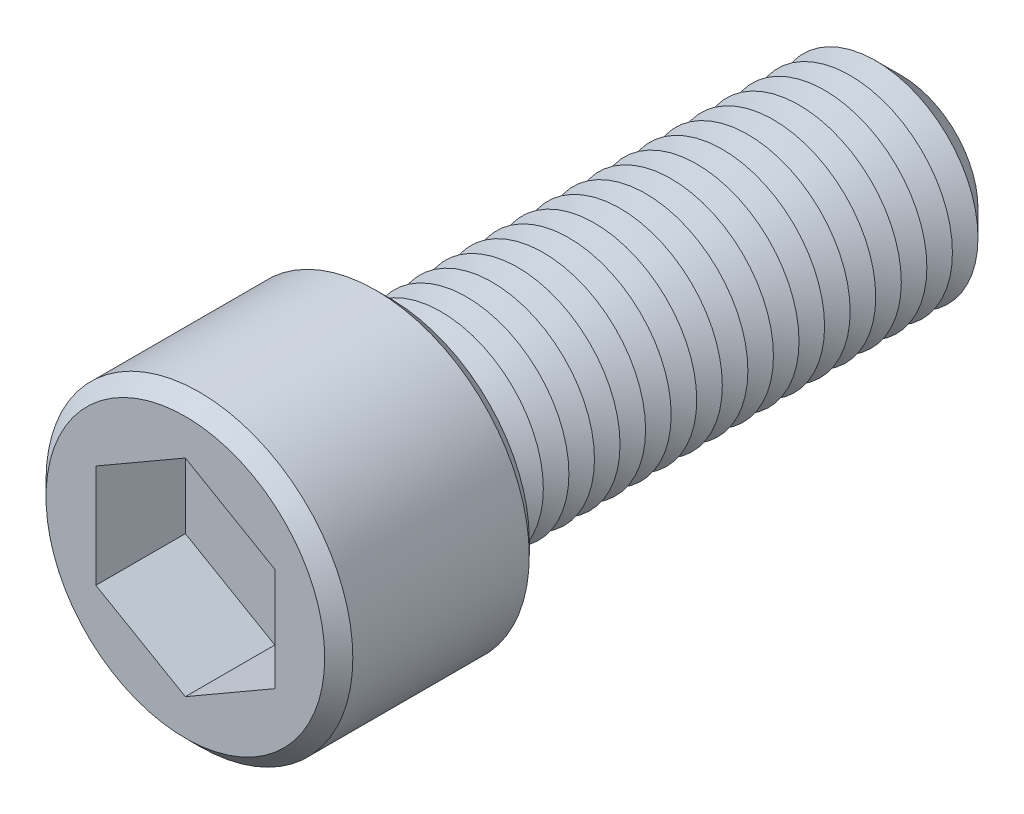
ISO-10303-21;
HEADER;
FILE_DESCRIPTION(('STEP AP214'),'2;1');
FILE_NAME('part.step','',(''),(''),'','','');
FILE_SCHEMA(('AUTOMOTIVE_DESIGN { 1 0 10303 214 1 1 1 1 }'));
ENDSEC;
DATA;
#1=APPLICATION_CONTEXT('core data for automotive mechanical design processes');
#2=APPLICATION_PROTOCOL_DEFINITION('international standard','automotive_design',2000,#1);
#3=PRODUCT_CONTEXT('',#1,'mechanical');
#4=PRODUCT('Part','Part','',(#3));
#5=PRODUCT_RELATED_PRODUCT_CATEGORY('part','',(#4));
#6=PRODUCT_DEFINITION_FORMATION('','',#4);
#7=PRODUCT_DEFINITION_CONTEXT('part definition',#1,'design');
#8=PRODUCT_DEFINITION('design','',#6,#7);
#9=PRODUCT_DEFINITION_SHAPE('','',#8);
#10=(LENGTH_UNIT() NAMED_UNIT(*) SI_UNIT(.MILLI.,.METRE.));
#11=(NAMED_UNIT(*) PLANE_ANGLE_UNIT() SI_UNIT($,.RADIAN.));
#12=(NAMED_UNIT(*) SI_UNIT($,.STERADIAN.) SOLID_ANGLE_UNIT());
#13=UNCERTAINTY_MEASURE_WITH_UNIT(LENGTH_MEASURE(1.E-05),#10,'distance_accuracy_value','');
#14=(GEOMETRIC_REPRESENTATION_CONTEXT(3) GLOBAL_UNCERTAINTY_ASSIGNED_CONTEXT((#13)) GLOBAL_UNIT_ASSIGNED_CONTEXT((#10,
#11,#12)) REPRESENTATION_CONTEXT('',''));
#15=CARTESIAN_POINT('',(0.,0.,0.));
#16=DIRECTION('',(0.,0.,1.));
#17=DIRECTION('',(1.,0.,0.));
#18=AXIS2_PLACEMENT_3D('',#15,#16,#17);
#19=CARTESIAN_POINT('',(0.,0.,16.));
#20=DIRECTION('',(0.,0.,-1.));
#21=DIRECTION('',(-1.,0.,0.));
#22=AXIS2_PLACEMENT_3D('',#19,#20,#21);
#23=CYLINDRICAL_SURFACE('',#22,12.);
#24=CARTESIAN_POINT('',(0.,0.,1.09999999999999));
#25=DIRECTION('',(0.,0.,1.));
#26=DIRECTION('',(1.,0.,0.));
#27=AXIS2_PLACEMENT_3D('',#24,#25,#26);
#28=CIRCLE('',#27,12.);
#29=CARTESIAN_POINT('',(12.,0.,1.09999999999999));
#30=VERTEX_POINT('',#29);
#31=EDGE_CURVE('E328',#30,#30,#28,.T.);
#32=ORIENTED_EDGE('',*,*,#31,.T.);
#33=EDGE_LOOP('',(#32));
#34=FACE_BOUND('',#33,.T.);
#35=CARTESIAN_POINT('',(0.,0.,14.9));
#36=DIRECTION('',(0.,0.,1.));
#37=DIRECTION('',(1.,0.,0.));
#38=AXIS2_PLACEMENT_3D('',#35,#36,#37);
#39=CIRCLE('',#38,12.);
#40=CARTESIAN_POINT('',(12.,0.,14.9));
#41=VERTEX_POINT('',#40);
#42=EDGE_CURVE('E324',#41,#41,#39,.F.);
#43=ORIENTED_EDGE('',*,*,#42,.T.);
#44=EDGE_LOOP('',(#43));
#45=FACE_BOUND('',#44,.T.);
#46=ADVANCED_FACE('F39',(#34,#45),#23,.T.);
#47=CARTESIAN_POINT('',(0.,0.,16.));
#48=DIRECTION('',(0.,0.,1.));
#49=DIRECTION('',(1.,0.,0.));
#50=AXIS2_PLACEMENT_3D('',#47,#48,#49);
#51=PLANE('',#50);
#52=CARTESIAN_POINT('',(0.,0.,16.));
#53=DIRECTION('',(0.,0.,1.));
#54=DIRECTION('',(1.,0.,0.));
#55=AXIS2_PLACEMENT_3D('',#52,#53,#54);
#56=CIRCLE('',#55,10.9);
#57=CARTESIAN_POINT('',(10.9,0.,16.));
#58=VERTEX_POINT('',#57);
#59=EDGE_CURVE('E11',#58,#58,#56,.T.);
#60=ORIENTED_EDGE('',*,*,#59,.T.);
#61=EDGE_LOOP('',(#60));
#62=FACE_BOUND('',#61,.T.);
#63=DIRECTION('',(-0.866025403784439,0.5,0.));
#64=VECTOR('',#63,1.);
#65=CARTESIAN_POINT('',(7.,4.04145188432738,16.));
#66=LINE('',#65,#64);
#67=CARTESIAN_POINT('',(7.,4.04145188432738,16.));
#68=VERTEX_POINT('',#67);
#69=CARTESIAN_POINT('',(0.,8.08290376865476,16.));
#70=VERTEX_POINT('',#69);
#71=EDGE_CURVE('E55',#68,#70,#66,.T.);
#72=ORIENTED_EDGE('',*,*,#71,.F.);
#73=DIRECTION('',(0.,1.,0.));
#74=VECTOR('',#73,1.);
#75=CARTESIAN_POINT('',(7.,-4.04145188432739,16.));
#76=LINE('',#75,#74);
#77=CARTESIAN_POINT('',(7.,-4.04145188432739,16.));
#78=VERTEX_POINT('',#77);
#79=EDGE_CURVE('E150',#78,#68,#76,.T.);
#80=ORIENTED_EDGE('',*,*,#79,.F.);
#81=DIRECTION('',(0.866025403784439,0.5,0.));
#82=VECTOR('',#81,1.);
#83=CARTESIAN_POINT('',(0.,-8.08290376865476,16.));
#84=LINE('',#83,#82);
#85=CARTESIAN_POINT('',(0.,-8.08290376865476,16.));
#86=VERTEX_POINT('',#85);
#87=EDGE_CURVE('E147',#86,#78,#84,.T.);
#88=ORIENTED_EDGE('',*,*,#87,.F.);
#89=DIRECTION('',(0.866025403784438,-0.5,0.));
#90=VECTOR('',#89,1.);
#91=CARTESIAN_POINT('',(-7.,-4.04145188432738,16.));
#92=LINE('',#91,#90);
#93=CARTESIAN_POINT('',(-7.,-4.04145188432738,16.));
#94=VERTEX_POINT('',#93);
#95=EDGE_CURVE('E103',#94,#86,#92,.T.);
#96=ORIENTED_EDGE('',*,*,#95,.F.);
#97=DIRECTION('',(0.,-1.,0.));
#98=VECTOR('',#97,1.);
#99=CARTESIAN_POINT('',(-7.,4.04145188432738,16.));
#100=LINE('',#99,#98);
#101=CARTESIAN_POINT('',(-7.,4.04145188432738,16.));
#102=VERTEX_POINT('',#101);
#103=EDGE_CURVE('E141',#102,#94,#100,.T.);
#104=ORIENTED_EDGE('',*,*,#103,.F.);
#105=DIRECTION('',(-0.866025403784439,-0.5,0.));
#106=VECTOR('',#105,1.);
#107=CARTESIAN_POINT('',(0.,8.08290376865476,16.));
#108=LINE('',#107,#106);
#109=EDGE_CURVE('E136',#70,#102,#108,.T.);
#110=ORIENTED_EDGE('',*,*,#109,.F.);
#111=EDGE_LOOP('',(#72,#80,#88,#96,#104,#110));
#112=FACE_BOUND('',#111,.T.);
#113=ADVANCED_FACE('F346',(#62,#112),#51,.T.);
#114=CARTESIAN_POINT('',(0.,0.,0.));
#115=DIRECTION('',(0.,0.,1.));
#116=DIRECTION('',(1.,0.,0.));
#117=AXIS2_PLACEMENT_3D('',#114,#115,#116);
#118=PLANE('',#117);
#119=CARTESIAN_POINT('',(0.,0.,0.));
#120=DIRECTION('',(0.,0.,1.));
#121=DIRECTION('',(1.,0.,0.));
#122=AXIS2_PLACEMENT_3D('',#119,#120,#121);
#123=CIRCLE('',#122,10.9);
#124=CARTESIAN_POINT('',(10.9,0.,0.));
#125=VERTEX_POINT('',#124);
#126=EDGE_CURVE('E48',#125,#125,#123,.F.);
#127=ORIENTED_EDGE('',*,*,#126,.T.);
#128=EDGE_LOOP('',(#127));
#129=FACE_BOUND('',#128,.T.);
#130=CARTESIAN_POINT('',(0.,0.,0.));
#131=DIRECTION('',(0.,0.,1.));
#132=DIRECTION('',(1.,0.,0.));
#133=AXIS2_PLACEMENT_3D('',#130,#131,#132);
#134=CIRCLE('',#133,8.);
#135=CARTESIAN_POINT('',(8.,0.,0.));
#136=VERTEX_POINT('',#135);
#137=EDGE_CURVE('E316',#136,#136,#134,.T.);
#138=ORIENTED_EDGE('',*,*,#137,.T.);
#139=EDGE_LOOP('',(#138));
#140=FACE_BOUND('',#139,.T.);
#141=ADVANCED_FACE('F335',(#129,#140),#118,.F.);
#142=CARTESIAN_POINT('',(0.,0.,0.));
#143=DIRECTION('',(0.,0.,1.));
#144=DIRECTION('',(1.,0.,0.));
#145=AXIS2_PLACEMENT_3D('',#142,#143,#144);
#146=CONICAL_SURFACE('',#145,8.,1.0471975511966);
#147=CARTESIAN_POINT('',(0.,0.,-1.));
#148=DIRECTION('',(0.,0.,1.));
#149=DIRECTION('',(1.,0.,0.));
#150=AXIS2_PLACEMENT_3D('',#147,#148,#149);
#151=CIRCLE('',#150,6.26794919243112);
#152=CARTESIAN_POINT('',(6.26794919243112,0.,-1.));
#153=VERTEX_POINT('',#152);
#154=EDGE_CURVE('E312',#153,#153,#151,.T.);
#155=ORIENTED_EDGE('',*,*,#154,.T.);
#156=EDGE_LOOP('',(#155));
#157=FACE_BOUND('',#156,.T.);
#158=ORIENTED_EDGE('',*,*,#137,.F.);
#159=EDGE_LOOP('',(#158));
#160=FACE_BOUND('',#159,.T.);
#161=ADVANCED_FACE('F548',(#157,#160),#146,.T.);
#162=CARTESIAN_POINT('',(0.,0.,-1.));
#163=DIRECTION('',(0.,0.,-1.));
#164=DIRECTION('',(-1.,0.,0.));
#165=AXIS2_PLACEMENT_3D('',#162,#163,#164);
#166=CONICAL_SURFACE('',#165,6.26794919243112,1.0471975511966);
#167=CARTESIAN_POINT('',(0.,0.,-2.));
#168=DIRECTION('',(0.,0.,1.));
#169=DIRECTION('',(1.,0.,0.));
#170=AXIS2_PLACEMENT_3D('',#167,#168,#169);
#171=CIRCLE('',#170,8.);
#172=CARTESIAN_POINT('',(8.,0.,-2.));
#173=VERTEX_POINT('',#172);
#174=EDGE_CURVE('E308',#173,#173,#171,.T.);
#175=ORIENTED_EDGE('',*,*,#174,.T.);
#176=EDGE_LOOP('',(#175));
#177=FACE_BOUND('',#176,.T.);
#178=ORIENTED_EDGE('',*,*,#154,.F.);
#179=EDGE_LOOP('',(#178));
#180=FACE_BOUND('',#179,.T.);
#181=ADVANCED_FACE('F544',(#177,#180),#166,.T.);
#182=CARTESIAN_POINT('',(0.,0.,-2.));
#183=DIRECTION('',(0.,0.,1.));
#184=DIRECTION('',(1.,0.,0.));
#185=AXIS2_PLACEMENT_3D('',#182,#183,#184);
#186=CONICAL_SURFACE('',#185,8.,1.0471975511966);
#187=CARTESIAN_POINT('',(0.,0.,-3.));
#188=DIRECTION('',(0.,0.,1.));
#189=DIRECTION('',(1.,0.,0.));
#190=AXIS2_PLACEMENT_3D('',#187,#188,#189);
#191=CIRCLE('',#190,6.26794919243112);
#192=CARTESIAN_POINT('',(6.26794919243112,0.,-3.));
#193=VERTEX_POINT('',#192);
#194=EDGE_CURVE('E304',#193,#193,#191,.T.);
#195=ORIENTED_EDGE('',*,*,#194,.T.);
#196=EDGE_LOOP('',(#195));
#197=FACE_BOUND('',#196,.T.);
#198=ORIENTED_EDGE('',*,*,#174,.F.);
#199=EDGE_LOOP('',(#198));
#200=FACE_BOUND('',#199,.T.);
#201=ADVANCED_FACE('F540',(#197,#200),#186,.T.);
#202=CARTESIAN_POINT('',(0.,0.,-3.));
#203=DIRECTION('',(0.,0.,-1.));
#204=DIRECTION('',(-1.,0.,0.));
#205=AXIS2_PLACEMENT_3D('',#202,#203,#204);
#206=CONICAL_SURFACE('',#205,6.26794919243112,1.0471975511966);
#207=CARTESIAN_POINT('',(0.,0.,-4.));
#208=DIRECTION('',(0.,0.,1.));
#209=DIRECTION('',(1.,0.,0.));
#210=AXIS2_PLACEMENT_3D('',#207,#208,#209);
#211=CIRCLE('',#210,8.);
#212=CARTESIAN_POINT('',(8.,0.,-4.));
#213=VERTEX_POINT('',#212);
#214=EDGE_CURVE('E300',#213,#213,#211,.T.);
#215=ORIENTED_EDGE('',*,*,#214,.T.);
#216=EDGE_LOOP('',(#215));
#217=FACE_BOUND('',#216,.T.);
#218=ORIENTED_EDGE('',*,*,#194,.F.);
#219=EDGE_LOOP('',(#218));
#220=FACE_BOUND('',#219,.T.);
#221=ADVANCED_FACE('F536',(#217,#220),#206,.T.);
#222=CARTESIAN_POINT('',(0.,0.,-4.));
#223=DIRECTION('',(0.,0.,1.));
#224=DIRECTION('',(1.,0.,0.));
#225=AXIS2_PLACEMENT_3D('',#222,#223,#224);
#226=CONICAL_SURFACE('',#225,8.,1.0471975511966);
#227=CARTESIAN_POINT('',(0.,0.,-5.));
#228=DIRECTION('',(0.,0.,1.));
#229=DIRECTION('',(1.,0.,0.));
#230=AXIS2_PLACEMENT_3D('',#227,#228,#229);
#231=CIRCLE('',#230,6.26794919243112);
#232=CARTESIAN_POINT('',(6.26794919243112,0.,-5.));
#233=VERTEX_POINT('',#232);
#234=EDGE_CURVE('E297',#233,#233,#231,.T.);
#235=ORIENTED_EDGE('',*,*,#234,.T.);
#236=EDGE_LOOP('',(#235));
#237=FACE_BOUND('',#236,.T.);
#238=ORIENTED_EDGE('',*,*,#214,.F.);
#239=EDGE_LOOP('',(#238));
#240=FACE_BOUND('',#239,.T.);
#241=ADVANCED_FACE('F532',(#237,#240),#226,.T.);
#242=CARTESIAN_POINT('',(0.,0.,-5.));
#243=DIRECTION('',(0.,0.,-1.));
#244=DIRECTION('',(-1.,0.,0.));
#245=AXIS2_PLACEMENT_3D('',#242,#243,#244);
#246=CONICAL_SURFACE('',#245,6.26794919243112,1.0471975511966);
#247=CARTESIAN_POINT('',(0.,0.,-6.));
#248=DIRECTION('',(0.,0.,1.));
#249=DIRECTION('',(1.,0.,0.));
#250=AXIS2_PLACEMENT_3D('',#247,#248,#249);
#251=CIRCLE('',#250,8.);
#252=CARTESIAN_POINT('',(8.,0.,-6.));
#253=VERTEX_POINT('',#252);
#254=EDGE_CURVE('E293',#253,#253,#251,.T.);
#255=ORIENTED_EDGE('',*,*,#254,.T.);
#256=EDGE_LOOP('',(#255));
#257=FACE_BOUND('',#256,.T.);
#258=ORIENTED_EDGE('',*,*,#234,.F.);
#259=EDGE_LOOP('',(#258));
#260=FACE_BOUND('',#259,.T.);
#261=ADVANCED_FACE('F528',(#257,#260),#246,.T.);
#262=CARTESIAN_POINT('',(0.,0.,-6.));
#263=DIRECTION('',(0.,0.,1.));
#264=DIRECTION('',(1.,0.,0.));
#265=AXIS2_PLACEMENT_3D('',#262,#263,#264);
#266=CONICAL_SURFACE('',#265,8.,1.0471975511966);
#267=CARTESIAN_POINT('',(0.,0.,-7.));
#268=DIRECTION('',(0.,0.,1.));
#269=DIRECTION('',(1.,0.,0.));
#270=AXIS2_PLACEMENT_3D('',#267,#268,#269);
#271=CIRCLE('',#270,6.26794919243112);
#272=CARTESIAN_POINT('',(6.26794919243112,0.,-7.));
#273=VERTEX_POINT('',#272);
#274=EDGE_CURVE('E289',#273,#273,#271,.T.);
#275=ORIENTED_EDGE('',*,*,#274,.T.);
#276=EDGE_LOOP('',(#275));
#277=FACE_BOUND('',#276,.T.);
#278=ORIENTED_EDGE('',*,*,#254,.F.);
#279=EDGE_LOOP('',(#278));
#280=FACE_BOUND('',#279,.T.);
#281=ADVANCED_FACE('F524',(#277,#280),#266,.T.);
#282=CARTESIAN_POINT('',(0.,0.,-7.));
#283=DIRECTION('',(0.,0.,-1.));
#284=DIRECTION('',(-1.,0.,0.));
#285=AXIS2_PLACEMENT_3D('',#282,#283,#284);
#286=CONICAL_SURFACE('',#285,6.26794919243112,1.0471975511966);
#287=CARTESIAN_POINT('',(0.,0.,-8.));
#288=DIRECTION('',(0.,0.,1.));
#289=DIRECTION('',(1.,0.,0.));
#290=AXIS2_PLACEMENT_3D('',#287,#288,#289);
#291=CIRCLE('',#290,8.);
#292=CARTESIAN_POINT('',(8.,0.,-8.));
#293=VERTEX_POINT('',#292);
#294=EDGE_CURVE('E285',#293,#293,#291,.T.);
#295=ORIENTED_EDGE('',*,*,#294,.T.);
#296=EDGE_LOOP('',(#295));
#297=FACE_BOUND('',#296,.T.);
#298=ORIENTED_EDGE('',*,*,#274,.F.);
#299=EDGE_LOOP('',(#298));
#300=FACE_BOUND('',#299,.T.);
#301=ADVANCED_FACE('F520',(#297,#300),#286,.T.);
#302=CARTESIAN_POINT('',(0.,0.,-8.));
#303=DIRECTION('',(0.,0.,1.));
#304=DIRECTION('',(1.,0.,0.));
#305=AXIS2_PLACEMENT_3D('',#302,#303,#304);
#306=CONICAL_SURFACE('',#305,8.,1.0471975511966);
#307=CARTESIAN_POINT('',(0.,0.,-9.));
#308=DIRECTION('',(0.,0.,1.));
#309=DIRECTION('',(1.,0.,0.));
#310=AXIS2_PLACEMENT_3D('',#307,#308,#309);
#311=CIRCLE('',#310,6.26794919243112);
#312=CARTESIAN_POINT('',(6.26794919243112,0.,-9.));
#313=VERTEX_POINT('',#312);
#314=EDGE_CURVE('E281',#313,#313,#311,.T.);
#315=ORIENTED_EDGE('',*,*,#314,.T.);
#316=EDGE_LOOP('',(#315));
#317=FACE_BOUND('',#316,.T.);
#318=ORIENTED_EDGE('',*,*,#294,.F.);
#319=EDGE_LOOP('',(#318));
#320=FACE_BOUND('',#319,.T.);
#321=ADVANCED_FACE('F516',(#317,#320),#306,.T.);
#322=CARTESIAN_POINT('',(0.,0.,-9.));
#323=DIRECTION('',(0.,0.,-1.));
#324=DIRECTION('',(-1.,0.,0.));
#325=AXIS2_PLACEMENT_3D('',#322,#323,#324);
#326=CONICAL_SURFACE('',#325,6.26794919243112,1.0471975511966);
#327=CARTESIAN_POINT('',(0.,0.,-10.));
#328=DIRECTION('',(0.,0.,1.));
#329=DIRECTION('',(1.,0.,0.));
#330=AXIS2_PLACEMENT_3D('',#327,#328,#329);
#331=CIRCLE('',#330,8.);
#332=CARTESIAN_POINT('',(8.,0.,-10.));
#333=VERTEX_POINT('',#332);
#334=EDGE_CURVE('E277',#333,#333,#331,.T.);
#335=ORIENTED_EDGE('',*,*,#334,.T.);
#336=EDGE_LOOP('',(#335));
#337=FACE_BOUND('',#336,.T.);
#338=ORIENTED_EDGE('',*,*,#314,.F.);
#339=EDGE_LOOP('',(#338));
#340=FACE_BOUND('',#339,.T.);
#341=ADVANCED_FACE('F512',(#337,#340),#326,.T.);
#342=CARTESIAN_POINT('',(0.,0.,-10.));
#343=DIRECTION('',(0.,0.,1.));
#344=DIRECTION('',(1.,0.,0.));
#345=AXIS2_PLACEMENT_3D('',#342,#343,#344);
#346=CONICAL_SURFACE('',#345,8.,1.0471975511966);
#347=CARTESIAN_POINT('',(0.,0.,-11.));
#348=DIRECTION('',(0.,0.,1.));
#349=DIRECTION('',(1.,0.,0.));
#350=AXIS2_PLACEMENT_3D('',#347,#348,#349);
#351=CIRCLE('',#350,6.26794919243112);
#352=CARTESIAN_POINT('',(6.26794919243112,0.,-11.));
#353=VERTEX_POINT('',#352);
#354=EDGE_CURVE('E273',#353,#353,#351,.T.);
#355=ORIENTED_EDGE('',*,*,#354,.T.);
#356=EDGE_LOOP('',(#355));
#357=FACE_BOUND('',#356,.T.);
#358=ORIENTED_EDGE('',*,*,#334,.F.);
#359=EDGE_LOOP('',(#358));
#360=FACE_BOUND('',#359,.T.);
#361=ADVANCED_FACE('F508',(#357,#360),#346,.T.);
#362=CARTESIAN_POINT('',(0.,0.,-11.));
#363=DIRECTION('',(0.,0.,-1.));
#364=DIRECTION('',(-1.,0.,0.));
#365=AXIS2_PLACEMENT_3D('',#362,#363,#364);
#366=CONICAL_SURFACE('',#365,6.26794919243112,1.0471975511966);
#367=CARTESIAN_POINT('',(0.,0.,-12.));
#368=DIRECTION('',(0.,0.,1.));
#369=DIRECTION('',(1.,0.,0.));
#370=AXIS2_PLACEMENT_3D('',#367,#368,#369);
#371=CIRCLE('',#370,8.);
#372=CARTESIAN_POINT('',(8.,0.,-12.));
#373=VERTEX_POINT('',#372);
#374=EDGE_CURVE('E269',#373,#373,#371,.T.);
#375=ORIENTED_EDGE('',*,*,#374,.T.);
#376=EDGE_LOOP('',(#375));
#377=FACE_BOUND('',#376,.T.);
#378=ORIENTED_EDGE('',*,*,#354,.F.);
#379=EDGE_LOOP('',(#378));
#380=FACE_BOUND('',#379,.T.);
#381=ADVANCED_FACE('F504',(#377,#380),#366,.T.);
#382=CARTESIAN_POINT('',(0.,0.,-12.));
#383=DIRECTION('',(0.,0.,1.));
#384=DIRECTION('',(1.,0.,0.));
#385=AXIS2_PLACEMENT_3D('',#382,#383,#384);
#386=CONICAL_SURFACE('',#385,8.,1.0471975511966);
#387=CARTESIAN_POINT('',(0.,0.,-13.));
#388=DIRECTION('',(0.,0.,1.));
#389=DIRECTION('',(1.,0.,0.));
#390=AXIS2_PLACEMENT_3D('',#387,#388,#389);
#391=CIRCLE('',#390,6.26794919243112);
#392=CARTESIAN_POINT('',(6.26794919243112,0.,-13.));
#393=VERTEX_POINT('',#392);
#394=EDGE_CURVE('E265',#393,#393,#391,.T.);
#395=ORIENTED_EDGE('',*,*,#394,.T.);
#396=EDGE_LOOP('',(#395));
#397=FACE_BOUND('',#396,.T.);
#398=ORIENTED_EDGE('',*,*,#374,.F.);
#399=EDGE_LOOP('',(#398));
#400=FACE_BOUND('',#399,.T.);
#401=ADVANCED_FACE('F500',(#397,#400),#386,.T.);
#402=CARTESIAN_POINT('',(0.,0.,-13.));
#403=DIRECTION('',(0.,0.,-1.));
#404=DIRECTION('',(-1.,0.,0.));
#405=AXIS2_PLACEMENT_3D('',#402,#403,#404);
#406=CONICAL_SURFACE('',#405,6.26794919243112,1.0471975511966);
#407=CARTESIAN_POINT('',(0.,0.,-14.));
#408=DIRECTION('',(0.,0.,1.));
#409=DIRECTION('',(1.,0.,0.));
#410=AXIS2_PLACEMENT_3D('',#407,#408,#409);
#411=CIRCLE('',#410,8.);
#412=CARTESIAN_POINT('',(8.,0.,-14.));
#413=VERTEX_POINT('',#412);
#414=EDGE_CURVE('E261',#413,#413,#411,.T.);
#415=ORIENTED_EDGE('',*,*,#414,.T.);
#416=EDGE_LOOP('',(#415));
#417=FACE_BOUND('',#416,.T.);
#418=ORIENTED_EDGE('',*,*,#394,.F.);
#419=EDGE_LOOP('',(#418));
#420=FACE_BOUND('',#419,.T.);
#421=ADVANCED_FACE('F496',(#417,#420),#406,.T.);
#422=CARTESIAN_POINT('',(0.,0.,-14.));
#423=DIRECTION('',(0.,0.,1.));
#424=DIRECTION('',(1.,0.,0.));
#425=AXIS2_PLACEMENT_3D('',#422,#423,#424);
#426=CONICAL_SURFACE('',#425,8.,1.0471975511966);
#427=CARTESIAN_POINT('',(0.,0.,-15.));
#428=DIRECTION('',(0.,0.,1.));
#429=DIRECTION('',(1.,0.,0.));
#430=AXIS2_PLACEMENT_3D('',#427,#428,#429);
#431=CIRCLE('',#430,6.26794919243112);
#432=CARTESIAN_POINT('',(6.26794919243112,0.,-15.));
#433=VERTEX_POINT('',#432);
#434=EDGE_CURVE('E257',#433,#433,#431,.T.);
#435=ORIENTED_EDGE('',*,*,#434,.T.);
#436=EDGE_LOOP('',(#435));
#437=FACE_BOUND('',#436,.T.);
#438=ORIENTED_EDGE('',*,*,#414,.F.);
#439=EDGE_LOOP('',(#438));
#440=FACE_BOUND('',#439,.T.);
#441=ADVANCED_FACE('F492',(#437,#440),#426,.T.);
#442=CARTESIAN_POINT('',(0.,0.,-15.));
#443=DIRECTION('',(0.,0.,-1.));
#444=DIRECTION('',(-1.,0.,0.));
#445=AXIS2_PLACEMENT_3D('',#442,#443,#444);
#446=CONICAL_SURFACE('',#445,6.26794919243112,1.0471975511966);
#447=CARTESIAN_POINT('',(0.,0.,-16.));
#448=DIRECTION('',(0.,0.,1.));
#449=DIRECTION('',(1.,0.,0.));
#450=AXIS2_PLACEMENT_3D('',#447,#448,#449);
#451=CIRCLE('',#450,8.);
#452=CARTESIAN_POINT('',(8.,0.,-16.));
#453=VERTEX_POINT('',#452);
#454=EDGE_CURVE('E253',#453,#453,#451,.T.);
#455=ORIENTED_EDGE('',*,*,#454,.T.);
#456=EDGE_LOOP('',(#455));
#457=FACE_BOUND('',#456,.T.);
#458=ORIENTED_EDGE('',*,*,#434,.F.);
#459=EDGE_LOOP('',(#458));
#460=FACE_BOUND('',#459,.T.);
#461=ADVANCED_FACE('F488',(#457,#460),#446,.T.);
#462=CARTESIAN_POINT('',(0.,0.,-16.));
#463=DIRECTION('',(0.,0.,1.));
#464=DIRECTION('',(1.,0.,0.));
#465=AXIS2_PLACEMENT_3D('',#462,#463,#464);
#466=CONICAL_SURFACE('',#465,8.,1.0471975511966);
#467=CARTESIAN_POINT('',(0.,0.,-17.));
#468=DIRECTION('',(0.,0.,1.));
#469=DIRECTION('',(1.,0.,0.));
#470=AXIS2_PLACEMENT_3D('',#467,#468,#469);
#471=CIRCLE('',#470,6.26794919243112);
#472=CARTESIAN_POINT('',(6.26794919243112,0.,-17.));
#473=VERTEX_POINT('',#472);
#474=EDGE_CURVE('E249',#473,#473,#471,.T.);
#475=ORIENTED_EDGE('',*,*,#474,.T.);
#476=EDGE_LOOP('',(#475));
#477=FACE_BOUND('',#476,.T.);
#478=ORIENTED_EDGE('',*,*,#454,.F.);
#479=EDGE_LOOP('',(#478));
#480=FACE_BOUND('',#479,.T.);
#481=ADVANCED_FACE('F484',(#477,#480),#466,.T.);
#482=CARTESIAN_POINT('',(0.,0.,-17.));
#483=DIRECTION('',(0.,0.,-1.));
#484=DIRECTION('',(-1.,0.,0.));
#485=AXIS2_PLACEMENT_3D('',#482,#483,#484);
#486=CONICAL_SURFACE('',#485,6.26794919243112,1.0471975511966);
#487=CARTESIAN_POINT('',(0.,0.,-18.));
#488=DIRECTION('',(0.,0.,1.));
#489=DIRECTION('',(1.,0.,0.));
#490=AXIS2_PLACEMENT_3D('',#487,#488,#489);
#491=CIRCLE('',#490,8.);
#492=CARTESIAN_POINT('',(8.,0.,-18.));
#493=VERTEX_POINT('',#492);
#494=EDGE_CURVE('E245',#493,#493,#491,.T.);
#495=ORIENTED_EDGE('',*,*,#494,.T.);
#496=EDGE_LOOP('',(#495));
#497=FACE_BOUND('',#496,.T.);
#498=ORIENTED_EDGE('',*,*,#474,.F.);
#499=EDGE_LOOP('',(#498));
#500=FACE_BOUND('',#499,.T.);
#501=ADVANCED_FACE('F480',(#497,#500),#486,.T.);
#502=CARTESIAN_POINT('',(0.,0.,-18.));
#503=DIRECTION('',(0.,0.,1.));
#504=DIRECTION('',(1.,0.,0.));
#505=AXIS2_PLACEMENT_3D('',#502,#503,#504);
#506=CONICAL_SURFACE('',#505,8.,1.0471975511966);
#507=CARTESIAN_POINT('',(0.,0.,-19.));
#508=DIRECTION('',(0.,0.,1.));
#509=DIRECTION('',(1.,0.,0.));
#510=AXIS2_PLACEMENT_3D('',#507,#508,#509);
#511=CIRCLE('',#510,6.26794919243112);
#512=CARTESIAN_POINT('',(6.26794919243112,0.,-19.));
#513=VERTEX_POINT('',#512);
#514=EDGE_CURVE('E241',#513,#513,#511,.T.);
#515=ORIENTED_EDGE('',*,*,#514,.T.);
#516=EDGE_LOOP('',(#515));
#517=FACE_BOUND('',#516,.T.);
#518=ORIENTED_EDGE('',*,*,#494,.F.);
#519=EDGE_LOOP('',(#518));
#520=FACE_BOUND('',#519,.T.);
#521=ADVANCED_FACE('F476',(#517,#520),#506,.T.);
#522=CARTESIAN_POINT('',(0.,0.,-19.));
#523=DIRECTION('',(0.,0.,-1.));
#524=DIRECTION('',(-1.,0.,0.));
#525=AXIS2_PLACEMENT_3D('',#522,#523,#524);
#526=CONICAL_SURFACE('',#525,6.26794919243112,1.0471975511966);
#527=CARTESIAN_POINT('',(0.,0.,-20.));
#528=DIRECTION('',(0.,0.,1.));
#529=DIRECTION('',(1.,0.,0.));
#530=AXIS2_PLACEMENT_3D('',#527,#528,#529);
#531=CIRCLE('',#530,8.);
#532=CARTESIAN_POINT('',(8.,0.,-20.));
#533=VERTEX_POINT('',#532);
#534=EDGE_CURVE('E237',#533,#533,#531,.T.);
#535=ORIENTED_EDGE('',*,*,#534,.T.);
#536=EDGE_LOOP('',(#535));
#537=FACE_BOUND('',#536,.T.);
#538=ORIENTED_EDGE('',*,*,#514,.F.);
#539=EDGE_LOOP('',(#538));
#540=FACE_BOUND('',#539,.T.);
#541=ADVANCED_FACE('F472',(#537,#540),#526,.T.);
#542=CARTESIAN_POINT('',(0.,0.,-20.));
#543=DIRECTION('',(0.,0.,1.));
#544=DIRECTION('',(1.,0.,0.));
#545=AXIS2_PLACEMENT_3D('',#542,#543,#544);
#546=CONICAL_SURFACE('',#545,8.,1.0471975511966);
#547=CARTESIAN_POINT('',(0.,0.,-21.));
#548=DIRECTION('',(0.,0.,1.));
#549=DIRECTION('',(1.,0.,0.));
#550=AXIS2_PLACEMENT_3D('',#547,#548,#549);
#551=CIRCLE('',#550,6.26794919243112);
#552=CARTESIAN_POINT('',(6.26794919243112,0.,-21.));
#553=VERTEX_POINT('',#552);
#554=EDGE_CURVE('E233',#553,#553,#551,.T.);
#555=ORIENTED_EDGE('',*,*,#554,.T.);
#556=EDGE_LOOP('',(#555));
#557=FACE_BOUND('',#556,.T.);
#558=ORIENTED_EDGE('',*,*,#534,.F.);
#559=EDGE_LOOP('',(#558));
#560=FACE_BOUND('',#559,.T.);
#561=ADVANCED_FACE('F468',(#557,#560),#546,.T.);
#562=CARTESIAN_POINT('',(0.,0.,-21.));
#563=DIRECTION('',(0.,0.,-1.));
#564=DIRECTION('',(-1.,0.,0.));
#565=AXIS2_PLACEMENT_3D('',#562,#563,#564);
#566=CONICAL_SURFACE('',#565,6.26794919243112,1.0471975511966);
#567=CARTESIAN_POINT('',(0.,0.,-22.));
#568=DIRECTION('',(0.,0.,1.));
#569=DIRECTION('',(1.,0.,0.));
#570=AXIS2_PLACEMENT_3D('',#567,#568,#569);
#571=CIRCLE('',#570,8.);
#572=CARTESIAN_POINT('',(8.,0.,-22.));
#573=VERTEX_POINT('',#572);
#574=EDGE_CURVE('E229',#573,#573,#571,.T.);
#575=ORIENTED_EDGE('',*,*,#574,.T.);
#576=EDGE_LOOP('',(#575));
#577=FACE_BOUND('',#576,.T.);
#578=ORIENTED_EDGE('',*,*,#554,.F.);
#579=EDGE_LOOP('',(#578));
#580=FACE_BOUND('',#579,.T.);
#581=ADVANCED_FACE('F464',(#577,#580),#566,.T.);
#582=CARTESIAN_POINT('',(0.,0.,-22.));
#583=DIRECTION('',(0.,0.,1.));
#584=DIRECTION('',(1.,0.,0.));
#585=AXIS2_PLACEMENT_3D('',#582,#583,#584);
#586=CONICAL_SURFACE('',#585,8.,1.0471975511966);
#587=CARTESIAN_POINT('',(0.,0.,-23.));
#588=DIRECTION('',(0.,0.,1.));
#589=DIRECTION('',(1.,0.,0.));
#590=AXIS2_PLACEMENT_3D('',#587,#588,#589);
#591=CIRCLE('',#590,6.26794919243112);
#592=CARTESIAN_POINT('',(6.26794919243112,0.,-23.));
#593=VERTEX_POINT('',#592);
#594=EDGE_CURVE('E225',#593,#593,#591,.T.);
#595=ORIENTED_EDGE('',*,*,#594,.T.);
#596=EDGE_LOOP('',(#595));
#597=FACE_BOUND('',#596,.T.);
#598=ORIENTED_EDGE('',*,*,#574,.F.);
#599=EDGE_LOOP('',(#598));
#600=FACE_BOUND('',#599,.T.);
#601=ADVANCED_FACE('F460',(#597,#600),#586,.T.);
#602=CARTESIAN_POINT('',(0.,0.,-23.));
#603=DIRECTION('',(0.,0.,-1.));
#604=DIRECTION('',(-1.,0.,0.));
#605=AXIS2_PLACEMENT_3D('',#602,#603,#604);
#606=CONICAL_SURFACE('',#605,6.26794919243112,1.0471975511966);
#607=CARTESIAN_POINT('',(0.,0.,-24.));
#608=DIRECTION('',(0.,0.,1.));
#609=DIRECTION('',(1.,0.,0.));
#610=AXIS2_PLACEMENT_3D('',#607,#608,#609);
#611=CIRCLE('',#610,8.);
#612=CARTESIAN_POINT('',(8.,0.,-24.));
#613=VERTEX_POINT('',#612);
#614=EDGE_CURVE('E221',#613,#613,#611,.T.);
#615=ORIENTED_EDGE('',*,*,#614,.T.);
#616=EDGE_LOOP('',(#615));
#617=FACE_BOUND('',#616,.T.);
#618=ORIENTED_EDGE('',*,*,#594,.F.);
#619=EDGE_LOOP('',(#618));
#620=FACE_BOUND('',#619,.T.);
#621=ADVANCED_FACE('F456',(#617,#620),#606,.T.);
#622=CARTESIAN_POINT('',(0.,0.,-24.));
#623=DIRECTION('',(0.,0.,1.));
#624=DIRECTION('',(1.,0.,0.));
#625=AXIS2_PLACEMENT_3D('',#622,#623,#624);
#626=CONICAL_SURFACE('',#625,8.,1.0471975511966);
#627=CARTESIAN_POINT('',(0.,0.,-25.));
#628=DIRECTION('',(0.,0.,1.));
#629=DIRECTION('',(1.,0.,0.));
#630=AXIS2_PLACEMENT_3D('',#627,#628,#629);
#631=CIRCLE('',#630,6.26794919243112);
#632=CARTESIAN_POINT('',(6.26794919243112,0.,-25.));
#633=VERTEX_POINT('',#632);
#634=EDGE_CURVE('E217',#633,#633,#631,.T.);
#635=ORIENTED_EDGE('',*,*,#634,.T.);
#636=EDGE_LOOP('',(#635));
#637=FACE_BOUND('',#636,.T.);
#638=ORIENTED_EDGE('',*,*,#614,.F.);
#639=EDGE_LOOP('',(#638));
#640=FACE_BOUND('',#639,.T.);
#641=ADVANCED_FACE('F452',(#637,#640),#626,.T.);
#642=CARTESIAN_POINT('',(0.,0.,-25.));
#643=DIRECTION('',(0.,0.,-1.));
#644=DIRECTION('',(-1.,0.,0.));
#645=AXIS2_PLACEMENT_3D('',#642,#643,#644);
#646=CONICAL_SURFACE('',#645,6.26794919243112,1.0471975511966);
#647=CARTESIAN_POINT('',(0.,0.,-26.));
#648=DIRECTION('',(0.,0.,1.));
#649=DIRECTION('',(1.,0.,0.));
#650=AXIS2_PLACEMENT_3D('',#647,#648,#649);
#651=CIRCLE('',#650,8.);
#652=CARTESIAN_POINT('',(8.,0.,-26.));
#653=VERTEX_POINT('',#652);
#654=EDGE_CURVE('E213',#653,#653,#651,.T.);
#655=ORIENTED_EDGE('',*,*,#654,.T.);
#656=EDGE_LOOP('',(#655));
#657=FACE_BOUND('',#656,.T.);
#658=ORIENTED_EDGE('',*,*,#634,.F.);
#659=EDGE_LOOP('',(#658));
#660=FACE_BOUND('',#659,.T.);
#661=ADVANCED_FACE('F448',(#657,#660),#646,.T.);
#662=CARTESIAN_POINT('',(0.,0.,-26.));
#663=DIRECTION('',(0.,0.,1.));
#664=DIRECTION('',(1.,0.,0.));
#665=AXIS2_PLACEMENT_3D('',#662,#663,#664);
#666=CONICAL_SURFACE('',#665,8.,1.0471975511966);
#667=CARTESIAN_POINT('',(0.,0.,-27.));
#668=DIRECTION('',(0.,0.,1.));
#669=DIRECTION('',(1.,0.,0.));
#670=AXIS2_PLACEMENT_3D('',#667,#668,#669);
#671=CIRCLE('',#670,6.26794919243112);
#672=CARTESIAN_POINT('',(6.26794919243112,0.,-27.));
#673=VERTEX_POINT('',#672);
#674=EDGE_CURVE('E209',#673,#673,#671,.T.);
#675=ORIENTED_EDGE('',*,*,#674,.T.);
#676=EDGE_LOOP('',(#675));
#677=FACE_BOUND('',#676,.T.);
#678=ORIENTED_EDGE('',*,*,#654,.F.);
#679=EDGE_LOOP('',(#678));
#680=FACE_BOUND('',#679,.T.);
#681=ADVANCED_FACE('F444',(#677,#680),#666,.T.);
#682=CARTESIAN_POINT('',(0.,0.,-27.));
#683=DIRECTION('',(0.,0.,-1.));
#684=DIRECTION('',(-1.,0.,0.));
#685=AXIS2_PLACEMENT_3D('',#682,#683,#684);
#686=CONICAL_SURFACE('',#685,6.26794919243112,1.0471975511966);
#687=CARTESIAN_POINT('',(0.,0.,-28.));
#688=DIRECTION('',(0.,0.,1.));
#689=DIRECTION('',(1.,0.,0.));
#690=AXIS2_PLACEMENT_3D('',#687,#688,#689);
#691=CIRCLE('',#690,8.);
#692=CARTESIAN_POINT('',(8.,0.,-28.));
#693=VERTEX_POINT('',#692);
#694=EDGE_CURVE('E205',#693,#693,#691,.T.);
#695=ORIENTED_EDGE('',*,*,#694,.T.);
#696=EDGE_LOOP('',(#695));
#697=FACE_BOUND('',#696,.T.);
#698=ORIENTED_EDGE('',*,*,#674,.F.);
#699=EDGE_LOOP('',(#698));
#700=FACE_BOUND('',#699,.T.);
#701=ADVANCED_FACE('F440',(#697,#700),#686,.T.);
#702=CARTESIAN_POINT('',(0.,0.,-28.));
#703=DIRECTION('',(0.,0.,1.));
#704=DIRECTION('',(1.,0.,0.));
#705=AXIS2_PLACEMENT_3D('',#702,#703,#704);
#706=CONICAL_SURFACE('',#705,8.,1.0471975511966);
#707=CARTESIAN_POINT('',(0.,0.,-29.));
#708=DIRECTION('',(0.,0.,1.));
#709=DIRECTION('',(1.,0.,0.));
#710=AXIS2_PLACEMENT_3D('',#707,#708,#709);
#711=CIRCLE('',#710,6.26794919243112);
#712=CARTESIAN_POINT('',(6.26794919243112,0.,-29.));
#713=VERTEX_POINT('',#712);
#714=EDGE_CURVE('E201',#713,#713,#711,.T.);
#715=ORIENTED_EDGE('',*,*,#714,.T.);
#716=EDGE_LOOP('',(#715));
#717=FACE_BOUND('',#716,.T.);
#718=ORIENTED_EDGE('',*,*,#694,.F.);
#719=EDGE_LOOP('',(#718));
#720=FACE_BOUND('',#719,.T.);
#721=ADVANCED_FACE('F436',(#717,#720),#706,.T.);
#722=CARTESIAN_POINT('',(0.,0.,-29.));
#723=DIRECTION('',(0.,0.,-1.));
#724=DIRECTION('',(-1.,0.,0.));
#725=AXIS2_PLACEMENT_3D('',#722,#723,#724);
#726=CONICAL_SURFACE('',#725,6.26794919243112,1.0471975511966);
#727=CARTESIAN_POINT('',(0.,0.,-30.));
#728=DIRECTION('',(0.,0.,1.));
#729=DIRECTION('',(1.,0.,0.));
#730=AXIS2_PLACEMENT_3D('',#727,#728,#729);
#731=CIRCLE('',#730,8.);
#732=CARTESIAN_POINT('',(8.,0.,-30.));
#733=VERTEX_POINT('',#732);
#734=EDGE_CURVE('E197',#733,#733,#731,.T.);
#735=ORIENTED_EDGE('',*,*,#734,.T.);
#736=EDGE_LOOP('',(#735));
#737=FACE_BOUND('',#736,.T.);
#738=ORIENTED_EDGE('',*,*,#714,.F.);
#739=EDGE_LOOP('',(#738));
#740=FACE_BOUND('',#739,.T.);
#741=ADVANCED_FACE('F432',(#737,#740),#726,.T.);
#742=CARTESIAN_POINT('',(0.,0.,-30.));
#743=DIRECTION('',(0.,0.,1.));
#744=DIRECTION('',(1.,0.,0.));
#745=AXIS2_PLACEMENT_3D('',#742,#743,#744);
#746=CONICAL_SURFACE('',#745,8.,1.0471975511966);
#747=CARTESIAN_POINT('',(0.,0.,-31.));
#748=DIRECTION('',(0.,0.,1.));
#749=DIRECTION('',(1.,0.,0.));
#750=AXIS2_PLACEMENT_3D('',#747,#748,#749);
#751=CIRCLE('',#750,6.26794919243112);
#752=CARTESIAN_POINT('',(6.26794919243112,0.,-31.));
#753=VERTEX_POINT('',#752);
#754=EDGE_CURVE('E193',#753,#753,#751,.T.);
#755=ORIENTED_EDGE('',*,*,#754,.T.);
#756=EDGE_LOOP('',(#755));
#757=FACE_BOUND('',#756,.T.);
#758=ORIENTED_EDGE('',*,*,#734,.F.);
#759=EDGE_LOOP('',(#758));
#760=FACE_BOUND('',#759,.T.);
#761=ADVANCED_FACE('F428',(#757,#760),#746,.T.);
#762=CARTESIAN_POINT('',(0.,0.,-31.));
#763=DIRECTION('',(0.,0.,-1.));
#764=DIRECTION('',(-1.,0.,0.));
#765=AXIS2_PLACEMENT_3D('',#762,#763,#764);
#766=CONICAL_SURFACE('',#765,6.26794919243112,1.0471975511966);
#767=CARTESIAN_POINT('',(0.,0.,-32.));
#768=DIRECTION('',(0.,0.,1.));
#769=DIRECTION('',(1.,0.,0.));
#770=AXIS2_PLACEMENT_3D('',#767,#768,#769);
#771=CIRCLE('',#770,8.);
#772=CARTESIAN_POINT('',(8.,0.,-32.));
#773=VERTEX_POINT('',#772);
#774=EDGE_CURVE('E189',#773,#773,#771,.T.);
#775=ORIENTED_EDGE('',*,*,#774,.T.);
#776=EDGE_LOOP('',(#775));
#777=FACE_BOUND('',#776,.T.);
#778=ORIENTED_EDGE('',*,*,#754,.F.);
#779=EDGE_LOOP('',(#778));
#780=FACE_BOUND('',#779,.T.);
#781=ADVANCED_FACE('F424',(#777,#780),#766,.T.);
#782=CARTESIAN_POINT('',(0.,0.,-32.));
#783=DIRECTION('',(0.,0.,1.));
#784=DIRECTION('',(1.,0.,0.));
#785=AXIS2_PLACEMENT_3D('',#782,#783,#784);
#786=CONICAL_SURFACE('',#785,8.,1.0471975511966);
#787=CARTESIAN_POINT('',(0.,0.,-33.));
#788=DIRECTION('',(0.,0.,1.));
#789=DIRECTION('',(1.,0.,0.));
#790=AXIS2_PLACEMENT_3D('',#787,#788,#789);
#791=CIRCLE('',#790,6.26794919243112);
#792=CARTESIAN_POINT('',(6.26794919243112,0.,-33.));
#793=VERTEX_POINT('',#792);
#794=EDGE_CURVE('E185',#793,#793,#791,.T.);
#795=ORIENTED_EDGE('',*,*,#794,.T.);
#796=EDGE_LOOP('',(#795));
#797=FACE_BOUND('',#796,.T.);
#798=ORIENTED_EDGE('',*,*,#774,.F.);
#799=EDGE_LOOP('',(#798));
#800=FACE_BOUND('',#799,.T.);
#801=ADVANCED_FACE('F420',(#797,#800),#786,.T.);
#802=CARTESIAN_POINT('',(0.,0.,-33.));
#803=DIRECTION('',(0.,0.,-1.));
#804=DIRECTION('',(-1.,0.,0.));
#805=AXIS2_PLACEMENT_3D('',#802,#803,#804);
#806=CONICAL_SURFACE('',#805,6.26794919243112,1.0471975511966);
#807=CARTESIAN_POINT('',(0.,0.,-34.));
#808=DIRECTION('',(0.,0.,1.));
#809=DIRECTION('',(1.,0.,0.));
#810=AXIS2_PLACEMENT_3D('',#807,#808,#809);
#811=CIRCLE('',#810,8.);
#812=CARTESIAN_POINT('',(8.,0.,-34.));
#813=VERTEX_POINT('',#812);
#814=EDGE_CURVE('E181',#813,#813,#811,.T.);
#815=ORIENTED_EDGE('',*,*,#814,.T.);
#816=EDGE_LOOP('',(#815));
#817=FACE_BOUND('',#816,.T.);
#818=ORIENTED_EDGE('',*,*,#794,.F.);
#819=EDGE_LOOP('',(#818));
#820=FACE_BOUND('',#819,.T.);
#821=ADVANCED_FACE('F416',(#817,#820),#806,.T.);
#822=CARTESIAN_POINT('',(0.,0.,-34.));
#823=DIRECTION('',(0.,0.,1.));
#824=DIRECTION('',(1.,0.,0.));
#825=AXIS2_PLACEMENT_3D('',#822,#823,#824);
#826=CONICAL_SURFACE('',#825,8.,1.0471975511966);
#827=CARTESIAN_POINT('',(0.,0.,-35.));
#828=DIRECTION('',(0.,0.,1.));
#829=DIRECTION('',(1.,0.,0.));
#830=AXIS2_PLACEMENT_3D('',#827,#828,#829);
#831=CIRCLE('',#830,6.26794919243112);
#832=CARTESIAN_POINT('',(6.26794919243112,0.,-35.));
#833=VERTEX_POINT('',#832);
#834=EDGE_CURVE('E177',#833,#833,#831,.T.);
#835=ORIENTED_EDGE('',*,*,#834,.T.);
#836=EDGE_LOOP('',(#835));
#837=FACE_BOUND('',#836,.T.);
#838=ORIENTED_EDGE('',*,*,#814,.F.);
#839=EDGE_LOOP('',(#838));
#840=FACE_BOUND('',#839,.T.);
#841=ADVANCED_FACE('F412',(#837,#840),#826,.T.);
#842=CARTESIAN_POINT('',(0.,0.,-35.));
#843=DIRECTION('',(0.,0.,-1.));
#844=DIRECTION('',(-1.,0.,0.));
#845=AXIS2_PLACEMENT_3D('',#842,#843,#844);
#846=CONICAL_SURFACE('',#845,6.26794919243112,1.0471975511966);
#847=CARTESIAN_POINT('',(0.,0.,-36.));
#848=DIRECTION('',(0.,0.,1.));
#849=DIRECTION('',(1.,0.,0.));
#850=AXIS2_PLACEMENT_3D('',#847,#848,#849);
#851=CIRCLE('',#850,8.);
#852=CARTESIAN_POINT('',(8.,0.,-36.));
#853=VERTEX_POINT('',#852);
#854=EDGE_CURVE('E173',#853,#853,#851,.T.);
#855=ORIENTED_EDGE('',*,*,#854,.T.);
#856=EDGE_LOOP('',(#855));
#857=FACE_BOUND('',#856,.T.);
#858=ORIENTED_EDGE('',*,*,#834,.F.);
#859=EDGE_LOOP('',(#858));
#860=FACE_BOUND('',#859,.T.);
#861=ADVANCED_FACE('F408',(#857,#860),#846,.T.);
#862=CARTESIAN_POINT('',(0.,0.,-36.));
#863=DIRECTION('',(0.,0.,1.));
#864=DIRECTION('',(1.,0.,0.));
#865=AXIS2_PLACEMENT_3D('',#862,#863,#864);
#866=CONICAL_SURFACE('',#865,8.,1.0471975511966);
#867=CARTESIAN_POINT('',(0.,0.,-37.));
#868=DIRECTION('',(0.,0.,1.));
#869=DIRECTION('',(1.,0.,0.));
#870=AXIS2_PLACEMENT_3D('',#867,#868,#869);
#871=CIRCLE('',#870,6.26794919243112);
#872=CARTESIAN_POINT('',(6.26794919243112,0.,-37.));
#873=VERTEX_POINT('',#872);
#874=EDGE_CURVE('E169',#873,#873,#871,.T.);
#875=ORIENTED_EDGE('',*,*,#874,.T.);
#876=EDGE_LOOP('',(#875));
#877=FACE_BOUND('',#876,.T.);
#878=ORIENTED_EDGE('',*,*,#854,.F.);
#879=EDGE_LOOP('',(#878));
#880=FACE_BOUND('',#879,.T.);
#881=ADVANCED_FACE('F404',(#877,#880),#866,.T.);
#882=CARTESIAN_POINT('',(0.,0.,-37.));
#883=DIRECTION('',(0.,0.,-1.));
#884=DIRECTION('',(-1.,0.,0.));
#885=AXIS2_PLACEMENT_3D('',#882,#883,#884);
#886=CONICAL_SURFACE('',#885,6.26794919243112,1.0471975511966);
#887=CARTESIAN_POINT('',(0.,0.,-38.));
#888=DIRECTION('',(0.,0.,1.));
#889=DIRECTION('',(1.,0.,0.));
#890=AXIS2_PLACEMENT_3D('',#887,#888,#889);
#891=CIRCLE('',#890,8.);
#892=CARTESIAN_POINT('',(8.,0.,-38.));
#893=VERTEX_POINT('',#892);
#894=EDGE_CURVE('E156',#893,#893,#891,.T.);
#895=ORIENTED_EDGE('',*,*,#894,.T.);
#896=EDGE_LOOP('',(#895));
#897=FACE_BOUND('',#896,.T.);
#898=ORIENTED_EDGE('',*,*,#874,.F.);
#899=EDGE_LOOP('',(#898));
#900=FACE_BOUND('',#899,.T.);
#901=ADVANCED_FACE('F400',(#897,#900),#886,.T.);
#902=CARTESIAN_POINT('',(0.,0.,-40.));
#903=DIRECTION('',(0.,0.,-1.));
#904=DIRECTION('',(-1.,0.,0.));
#905=AXIS2_PLACEMENT_3D('',#902,#903,#904);
#906=PLANE('',#905);
#907=CARTESIAN_POINT('',(0.,0.,-40.));
#908=DIRECTION('',(0.,0.,-1.));
#909=DIRECTION('',(-1.,0.,0.));
#910=AXIS2_PLACEMENT_3D('',#907,#908,#909);
#911=CIRCLE('',#910,0.9);
#912=CARTESIAN_POINT('',(-0.9,0.,-40.));
#913=VERTEX_POINT('',#912);
#914=EDGE_CURVE('E137',#913,#913,#911,.F.);
#915=ORIENTED_EDGE('',*,*,#914,.T.);
#916=EDGE_LOOP('',(#915));
#917=FACE_BOUND('',#916,.T.);
#918=CARTESIAN_POINT('',(0.,0.,-40.));
#919=DIRECTION('',(0.,0.,-1.));
#920=DIRECTION('',(-1.,0.,0.));
#921=AXIS2_PLACEMENT_3D('',#918,#919,#920);
#922=CIRCLE('',#921,6.00000000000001);
#923=CARTESIAN_POINT('',(-6.00000000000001,0.,-40.));
#924=VERTEX_POINT('',#923);
#925=EDGE_CURVE('E320',#924,#924,#922,.T.);
#926=ORIENTED_EDGE('',*,*,#925,.T.);
#927=EDGE_LOOP('',(#926));
#928=FACE_BOUND('',#927,.T.);
#929=ADVANCED_FACE('F403',(#917,#928),#906,.T.);
#930=CARTESIAN_POINT('',(0.,0.,-40.));
#931=DIRECTION('',(0.,0.,1.));
#932=DIRECTION('',(1.,0.,0.));
#933=AXIS2_PLACEMENT_3D('',#930,#931,#932);
#934=CONICAL_SURFACE('',#933,6.00000000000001,0.785398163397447);
#935=ORIENTED_EDGE('',*,*,#894,.F.);
#936=EDGE_LOOP('',(#935));
#937=FACE_BOUND('',#936,.T.);
#938=ORIENTED_EDGE('',*,*,#925,.F.);
#939=EDGE_LOOP('',(#938));
#940=FACE_BOUND('',#939,.T.);
#941=ADVANCED_FACE('F399',(#937,#940),#934,.T.);
#942=CARTESIAN_POINT('',(7.,4.04145188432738,9.));
#943=DIRECTION('',(0.5,0.866025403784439,0.));
#944=DIRECTION('',(-0.866025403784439,0.5,0.));
#945=AXIS2_PLACEMENT_3D('',#942,#943,#944);
#946=PLANE('',#945);
#947=ORIENTED_EDGE('',*,*,#71,.T.);
#948=DIRECTION('',(0.,0.,1.));
#949=VECTOR('',#948,1.);
#950=CARTESIAN_POINT('',(0.,8.08290376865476,9.));
#951=LINE('',#950,#949);
#952=CARTESIAN_POINT('',(0.,8.08290376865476,9.));
#953=VERTEX_POINT('',#952);
#954=EDGE_CURVE('E85',#953,#70,#951,.T.);
#955=ORIENTED_EDGE('',*,*,#954,.F.);
#956=DIRECTION('',(-0.866025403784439,0.5,0.));
#957=VECTOR('',#956,1.);
#958=CARTESIAN_POINT('',(7.,4.04145188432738,9.));
#959=LINE('',#958,#957);
#960=CARTESIAN_POINT('',(7.,4.04145188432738,9.));
#961=VERTEX_POINT('',#960);
#962=EDGE_CURVE('E153',#961,#953,#959,.T.);
#963=ORIENTED_EDGE('',*,*,#962,.F.);
#964=DIRECTION('',(0.,0.,1.));
#965=VECTOR('',#964,1.);
#966=CARTESIAN_POINT('',(7.,4.04145188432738,9.));
#967=LINE('',#966,#965);
#968=EDGE_CURVE('E63',#961,#68,#967,.T.);
#969=ORIENTED_EDGE('',*,*,#968,.T.);
#970=EDGE_LOOP('',(#947,#955,#963,#969));
#971=FACE_BOUND('',#970,.T.);
#972=ADVANCED_FACE('F389',(#971),#946,.F.);
#973=CARTESIAN_POINT('',(7.,-4.04145188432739,9.));
#974=DIRECTION('',(1.,0.,0.));
#975=DIRECTION('',(0.,1.,0.));
#976=AXIS2_PLACEMENT_3D('',#973,#974,#975);
#977=PLANE('',#976);
#978=ORIENTED_EDGE('',*,*,#79,.T.);
#979=ORIENTED_EDGE('',*,*,#968,.F.);
#980=DIRECTION('',(0.,1.,0.));
#981=VECTOR('',#980,1.);
#982=CARTESIAN_POINT('',(7.,-4.04145188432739,9.));
#983=LINE('',#982,#981);
#984=CARTESIAN_POINT('',(7.,-4.04145188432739,9.));
#985=VERTEX_POINT('',#984);
#986=EDGE_CURVE('E117',#985,#961,#983,.T.);
#987=ORIENTED_EDGE('',*,*,#986,.F.);
#988=DIRECTION('',(0.,0.,1.));
#989=VECTOR('',#988,1.);
#990=CARTESIAN_POINT('',(7.,-4.04145188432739,9.));
#991=LINE('',#990,#989);
#992=EDGE_CURVE('E108',#985,#78,#991,.T.);
#993=ORIENTED_EDGE('',*,*,#992,.T.);
#994=EDGE_LOOP('',(#978,#979,#987,#993));
#995=FACE_BOUND('',#994,.T.);
#996=ADVANCED_FACE('F386',(#995),#977,.F.);
#997=CARTESIAN_POINT('',(0.,-8.08290376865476,9.));
#998=DIRECTION('',(0.5,-0.866025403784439,0.));
#999=DIRECTION('',(0.866025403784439,0.5,0.));
#1000=AXIS2_PLACEMENT_3D('',#997,#998,#999);
#1001=PLANE('',#1000);
#1002=ORIENTED_EDGE('',*,*,#87,.T.);
#1003=ORIENTED_EDGE('',*,*,#992,.F.);
#1004=DIRECTION('',(0.866025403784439,0.5,0.));
#1005=VECTOR('',#1004,1.);
#1006=CARTESIAN_POINT('',(0.,-8.08290376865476,9.));
#1007=LINE('',#1006,#1005);
#1008=CARTESIAN_POINT('',(0.,-8.08290376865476,9.));
#1009=VERTEX_POINT('',#1008);
#1010=EDGE_CURVE('E112',#1009,#985,#1007,.T.);
#1011=ORIENTED_EDGE('',*,*,#1010,.F.);
#1012=DIRECTION('',(0.,0.,1.));
#1013=VECTOR('',#1012,1.);
#1014=CARTESIAN_POINT('',(0.,-8.08290376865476,9.));
#1015=LINE('',#1014,#1013);
#1016=EDGE_CURVE('E96',#1009,#86,#1015,.T.);
#1017=ORIENTED_EDGE('',*,*,#1016,.T.);
#1018=EDGE_LOOP('',(#1002,#1003,#1011,#1017));
#1019=FACE_BOUND('',#1018,.T.);
#1020=ADVANCED_FACE('F113',(#1019),#1001,.F.);
#1021=CARTESIAN_POINT('',(-7.,-4.04145188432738,9.));
#1022=DIRECTION('',(-0.5,-0.866025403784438,0.));
#1023=DIRECTION('',(0.866025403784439,-0.5,0.));
#1024=AXIS2_PLACEMENT_3D('',#1021,#1022,#1023);
#1025=PLANE('',#1024);
#1026=ORIENTED_EDGE('',*,*,#95,.T.);
#1027=ORIENTED_EDGE('',*,*,#1016,.F.);
#1028=DIRECTION('',(0.866025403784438,-0.5,0.));
#1029=VECTOR('',#1028,1.);
#1030=CARTESIAN_POINT('',(-7.,-4.04145188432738,9.));
#1031=LINE('',#1030,#1029);
#1032=CARTESIAN_POINT('',(-7.,-4.04145188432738,9.));
#1033=VERTEX_POINT('',#1032);
#1034=EDGE_CURVE('E100',#1033,#1009,#1031,.T.);
#1035=ORIENTED_EDGE('',*,*,#1034,.F.);
#1036=DIRECTION('',(0.,0.,1.));
#1037=VECTOR('',#1036,1.);
#1038=CARTESIAN_POINT('',(-7.,-4.04145188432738,9.));
#1039=LINE('',#1038,#1037);
#1040=EDGE_CURVE('E109',#1033,#94,#1039,.T.);
#1041=ORIENTED_EDGE('',*,*,#1040,.T.);
#1042=EDGE_LOOP('',(#1026,#1027,#1035,#1041));
#1043=FACE_BOUND('',#1042,.T.);
#1044=ADVANCED_FACE('F98',(#1043),#1025,.F.);
#1045=CARTESIAN_POINT('',(-7.,4.04145188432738,9.));
#1046=DIRECTION('',(-1.,0.,0.));
#1047=DIRECTION('',(0.,0.,1.));
#1048=AXIS2_PLACEMENT_3D('',#1045,#1046,#1047);
#1049=PLANE('',#1048);
#1050=ORIENTED_EDGE('',*,*,#103,.T.);
#1051=ORIENTED_EDGE('',*,*,#1040,.F.);
#1052=DIRECTION('',(0.,-1.,0.));
#1053=VECTOR('',#1052,1.);
#1054=CARTESIAN_POINT('',(-7.,4.04145188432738,9.));
#1055=LINE('',#1054,#1053);
#1056=CARTESIAN_POINT('',(-7.,4.04145188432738,9.));
#1057=VERTEX_POINT('',#1056);
#1058=EDGE_CURVE('E123',#1057,#1033,#1055,.T.);
#1059=ORIENTED_EDGE('',*,*,#1058,.F.);
#1060=DIRECTION('',(0.,0.,1.));
#1061=VECTOR('',#1060,1.);
#1062=CARTESIAN_POINT('',(-7.,4.04145188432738,9.));
#1063=LINE('',#1062,#1061);
#1064=EDGE_CURVE('E161',#1057,#102,#1063,.T.);
#1065=ORIENTED_EDGE('',*,*,#1064,.T.);
#1066=EDGE_LOOP('',(#1050,#1051,#1059,#1065));
#1067=FACE_BOUND('',#1066,.T.);
#1068=ADVANCED_FACE('F383',(#1067),#1049,.F.);
#1069=CARTESIAN_POINT('',(0.,8.08290376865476,9.));
#1070=DIRECTION('',(-0.5,0.866025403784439,0.));
#1071=DIRECTION('',(-0.866025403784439,-0.5,0.));
#1072=AXIS2_PLACEMENT_3D('',#1069,#1070,#1071);
#1073=PLANE('',#1072);
#1074=ORIENTED_EDGE('',*,*,#109,.T.);
#1075=ORIENTED_EDGE('',*,*,#1064,.F.);
#1076=DIRECTION('',(-0.866025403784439,-0.5,0.));
#1077=VECTOR('',#1076,1.);
#1078=CARTESIAN_POINT('',(0.,8.08290376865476,9.));
#1079=LINE('',#1078,#1077);
#1080=EDGE_CURVE('E129',#953,#1057,#1079,.T.);
#1081=ORIENTED_EDGE('',*,*,#1080,.F.);
#1082=ORIENTED_EDGE('',*,*,#954,.T.);
#1083=EDGE_LOOP('',(#1074,#1075,#1081,#1082));
#1084=FACE_BOUND('',#1083,.T.);
#1085=ADVANCED_FACE('F361',(#1084),#1073,.F.);
#1086=CARTESIAN_POINT('',(0.,0.,9.));
#1087=DIRECTION('',(0.,0.,1.));
#1088=DIRECTION('',(1.,0.,0.));
#1089=AXIS2_PLACEMENT_3D('',#1086,#1087,#1088);
#1090=PLANE('',#1089);
#1091=CARTESIAN_POINT('',(0.,0.,9.));
#1092=DIRECTION('',(0.,0.,1.));
#1093=DIRECTION('',(1.,0.,0.));
#1094=AXIS2_PLACEMENT_3D('',#1091,#1092,#1093);
#1095=CIRCLE('',#1094,0.9);
#1096=CARTESIAN_POINT('',(0.9,0.,9.));
#1097=VERTEX_POINT('',#1096);
#1098=EDGE_CURVE('E370',#1097,#1097,#1095,.T.);
#1099=ORIENTED_EDGE('',*,*,#1098,.F.);
#1100=EDGE_LOOP('',(#1099));
#1101=FACE_BOUND('',#1100,.T.);
#1102=ORIENTED_EDGE('',*,*,#962,.T.);
#1103=ORIENTED_EDGE('',*,*,#1080,.T.);
#1104=ORIENTED_EDGE('',*,*,#1058,.T.);
#1105=ORIENTED_EDGE('',*,*,#1034,.T.);
#1106=ORIENTED_EDGE('',*,*,#1010,.T.);
#1107=ORIENTED_EDGE('',*,*,#986,.T.);
#1108=EDGE_LOOP('',(#1102,#1103,#1104,#1105,#1106,#1107));
#1109=FACE_BOUND('',#1108,.T.);
#1110=ADVANCED_FACE('F120',(#1101,#1109),#1090,.T.);
#1111=CARTESIAN_POINT('',(0.,0.,-42.5455844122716));
#1112=DIRECTION('',(0.,0.,1.));
#1113=DIRECTION('',(1.,0.,0.));
#1114=AXIS2_PLACEMENT_3D('',#1111,#1112,#1113);
#1115=CYLINDRICAL_SURFACE('',#1114,0.9);
#1116=ORIENTED_EDGE('',*,*,#1098,.T.);
#1117=EDGE_LOOP('',(#1116));
#1118=FACE_BOUND('',#1117,.T.);
#1119=ORIENTED_EDGE('',*,*,#914,.F.);
#1120=EDGE_LOOP('',(#1119));
#1121=FACE_BOUND('',#1120,.T.);
#1122=ADVANCED_FACE('F341',(#1118,#1121),#1115,.F.);
#1123=CARTESIAN_POINT('',(0.,0.,1.09999999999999));
#1124=DIRECTION('',(0.,0.,1.));
#1125=DIRECTION('',(1.,0.,0.));
#1126=AXIS2_PLACEMENT_3D('',#1123,#1124,#1125);
#1127=CONICAL_SURFACE('',#1126,12.,0.785398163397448);
#1128=ORIENTED_EDGE('',*,*,#126,.F.);
#1129=EDGE_LOOP('',(#1128));
#1130=FACE_BOUND('',#1129,.T.);
#1131=ORIENTED_EDGE('',*,*,#31,.F.);
#1132=EDGE_LOOP('',(#1131));
#1133=FACE_BOUND('',#1132,.T.);
#1134=ADVANCED_FACE('F338',(#1130,#1133),#1127,.T.);
#1135=CARTESIAN_POINT('',(0.,0.,16.));
#1136=DIRECTION('',(0.,0.,-1.));
#1137=DIRECTION('',(-1.,0.,0.));
#1138=AXIS2_PLACEMENT_3D('',#1135,#1136,#1137);
#1139=CONICAL_SURFACE('',#1138,10.9,0.785398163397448);
#1140=ORIENTED_EDGE('',*,*,#42,.F.);
#1141=EDGE_LOOP('',(#1140));
#1142=FACE_BOUND('',#1141,.T.);
#1143=ORIENTED_EDGE('',*,*,#59,.F.);
#1144=EDGE_LOOP('',(#1143));
#1145=FACE_BOUND('',#1144,.T.);
#1146=ADVANCED_FACE('F41',(#1142,#1145),#1139,.T.);
#1147=CLOSED_SHELL('',(#46,#113,#141,#161,#181,#201,#221,#241,#261,#281,#301,#321,#341,#361,
#381,#401,#421,#441,#461,#481,#501,#521,#541,#561,#581,#601,#621,#641,#661,#681,#701,#721,#741,
#761,#781,#801,#821,#841,#861,#881,#901,#929,#941,#972,#996,#1020,#1044,#1068,#1085,#1110,#1122,
#1134,#1146));
#1148=MANIFOLD_SOLID_BREP('B2',#1147);
#1149=ADVANCED_BREP_SHAPE_REPRESENTATION('',(#18,#1148),#14);
#1150=SHAPE_DEFINITION_REPRESENTATION(#9,#1149);
ENDSEC;
END-ISO-10303-21;
